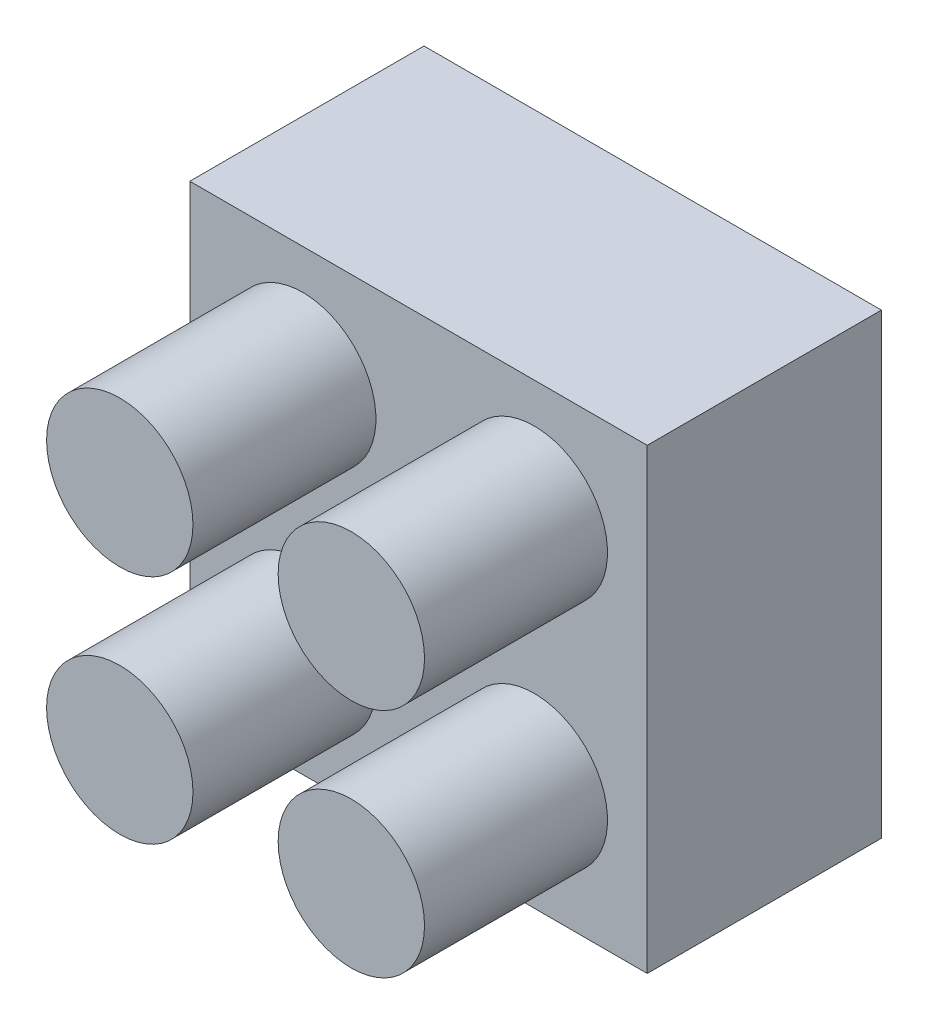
from build123d import *

# Parameters (mm, degrees)
SKETCH1_W           = 15.875
SKETCH1_H           = 15.875
BOSS_EXTRUDE1_DEPTH = 8.128
BOSS_EXTRUDE2_DEPTH = 6.35


with BuildPart() as part:
    # Sketch1 → Boss-Extrude1 (new body)
    with BuildSketch(Plane.XY):
        Rectangle(SKETCH1_W, SKETCH1_H)
    extrude(amount=BOSS_EXTRUDE1_DEPTH)

    # Sketch2 → Boss-Extrude2 (add)
    with BuildSketch(Plane.XY.offset(8.128)):
        with BuildLine():
            ThreePointArc((-1.478328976, 4.018328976), (-5.8143802, 5.8143802), (-4.018328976, 1.478328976))
            Line((-4.018328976, 1.478328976), (-4.018328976, 4.018328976))
            Line((-4.018328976, 4.018328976), (-1.478328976, 4.018328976))
        make_face()
        with BuildLine():
            Line((-4.018328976, 4.018328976), (-4.018328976, 1.478328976))
            ThreePointArc((-4.018328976, 1.478328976), (-2.222277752, 2.222277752), (-1.478328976, 4.018328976))
            Line((-1.478328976, 4.018328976), (-4.018328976, 4.018328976))
        make_face()
        with BuildLine():
            ThreePointArc((-1.478328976, 4.018328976), (-5.8143802, 5.8143802), (-4.018328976, 1.478328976))
            Line((-4.018328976, 1.478328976), (-4.018328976, 4.018328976))
            Line((-4.018328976, 4.018328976), (-1.478328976, 4.018328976))
        make_face()
        with BuildLine():
            Line((-4.018328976, 4.018328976), (-4.018328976, 1.478328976))
            ThreePointArc((-4.018328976, 1.478328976), (-2.222277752, 2.222277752), (-1.478328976, 4.018328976))
            Line((-1.478328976, 4.018328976), (-4.018328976, 4.018328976))
        make_face()
        with BuildLine():
            ThreePointArc((1.478328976, 4.018328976), (2.222277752, 2.222277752), (4.018328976, 1.478328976))
            Line((4.018328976, 1.478328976), (4.018328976, 4.018328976))
            Line((4.018328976, 4.018328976), (1.478328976, 4.018328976))
        make_face()
        with BuildLine():
            Line((4.018328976, 4.018328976), (4.018328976, 1.478328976))
            ThreePointArc((4.018328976, 1.478328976), (5.8143802, 2.222277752), (6.558328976, 4.018328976))
            ThreePointArc((6.558328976, 4.018328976), (4.018328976, 6.558328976), (1.478328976, 4.018328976))
            Line((1.478328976, 4.018328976), (4.018328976, 4.018328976))
        make_face()
        with BuildLine():
            ThreePointArc((1.478328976, 4.018328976), (2.222277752, 2.222277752), (4.018328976, 1.478328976))
            Line((4.018328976, 1.478328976), (4.018328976, 4.018328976))
            Line((4.018328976, 4.018328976), (1.478328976, 4.018328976))
        make_face()
        with BuildLine():
            Line((4.018328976, 4.018328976), (4.018328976, 1.478328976))
            ThreePointArc((4.018328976, 1.478328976), (5.8143802, 2.222277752), (6.558328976, 4.018328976))
            ThreePointArc((6.558328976, 4.018328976), (4.018328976, 6.558328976), (1.478328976, 4.018328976))
            Line((1.478328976, 4.018328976), (4.018328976, 4.018328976))
        make_face()
        with BuildLine():
            ThreePointArc((4.018328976, -1.478328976), (2.222277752, -2.222277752), (1.478328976, -4.018328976))
            Line((1.478328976, -4.018328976), (4.018328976, -4.018328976))
            Line((4.018328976, -4.018328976), (4.018328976, -1.478328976))
        make_face()
        with BuildLine():
            Line((4.018328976, -4.018328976), (1.478328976, -4.018328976))
            ThreePointArc((1.478328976, -4.018328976), (4.018328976, -6.558328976), (6.558328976, -4.018328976))
            ThreePointArc((6.558328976, -4.018328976), (5.8143802, -2.222277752), (4.018328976, -1.478328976))
            Line((4.018328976, -1.478328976), (4.018328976, -4.018328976))
        make_face()
        with BuildLine():
            ThreePointArc((4.018328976, -1.478328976), (2.222277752, -2.222277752), (1.478328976, -4.018328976))
            Line((1.478328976, -4.018328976), (4.018328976, -4.018328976))
            Line((4.018328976, -4.018328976), (4.018328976, -1.478328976))
        make_face()
        with BuildLine():
            Line((4.018328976, -4.018328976), (1.478328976, -4.018328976))
            ThreePointArc((1.478328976, -4.018328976), (4.018328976, -6.558328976), (6.558328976, -4.018328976))
            ThreePointArc((6.558328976, -4.018328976), (5.8143802, -2.222277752), (4.018328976, -1.478328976))
            Line((4.018328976, -1.478328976), (4.018328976, -4.018328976))
        make_face()
        with BuildLine():
            Line((-4.018328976, -1.478328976), (-4.018328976, -4.018328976))
            Line((-4.018328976, -4.018328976), (-1.478328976, -4.018328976))
            ThreePointArc((-1.478328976, -4.018328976), (-2.222277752, -2.222277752), (-4.018328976, -1.478328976))
        make_face()
        with BuildLine():
            Line((-1.478328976, -4.018328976), (-4.018328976, -4.018328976))
            Line((-4.018328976, -4.018328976), (-4.018328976, -1.478328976))
            ThreePointArc((-4.018328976, -1.478328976), (-5.8143802, -5.8143802), (-1.478328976, -4.018328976))
        make_face()
        with BuildLine():
            Line((-4.018328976, -1.478328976), (-4.018328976, -4.018328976))
            Line((-4.018328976, -4.018328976), (-1.478328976, -4.018328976))
            ThreePointArc((-1.478328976, -4.018328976), (-2.222277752, -2.222277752), (-4.018328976, -1.478328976))
        make_face()
        with BuildLine():
            Line((-1.478328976, -4.018328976), (-4.018328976, -4.018328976))
            Line((-4.018328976, -4.018328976), (-4.018328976, -1.478328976))
            ThreePointArc((-4.018328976, -1.478328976), (-5.8143802, -5.8143802), (-1.478328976, -4.018328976))
        make_face()
    extrude(amount=BOSS_EXTRUDE2_DEPTH)


solid = part.part
